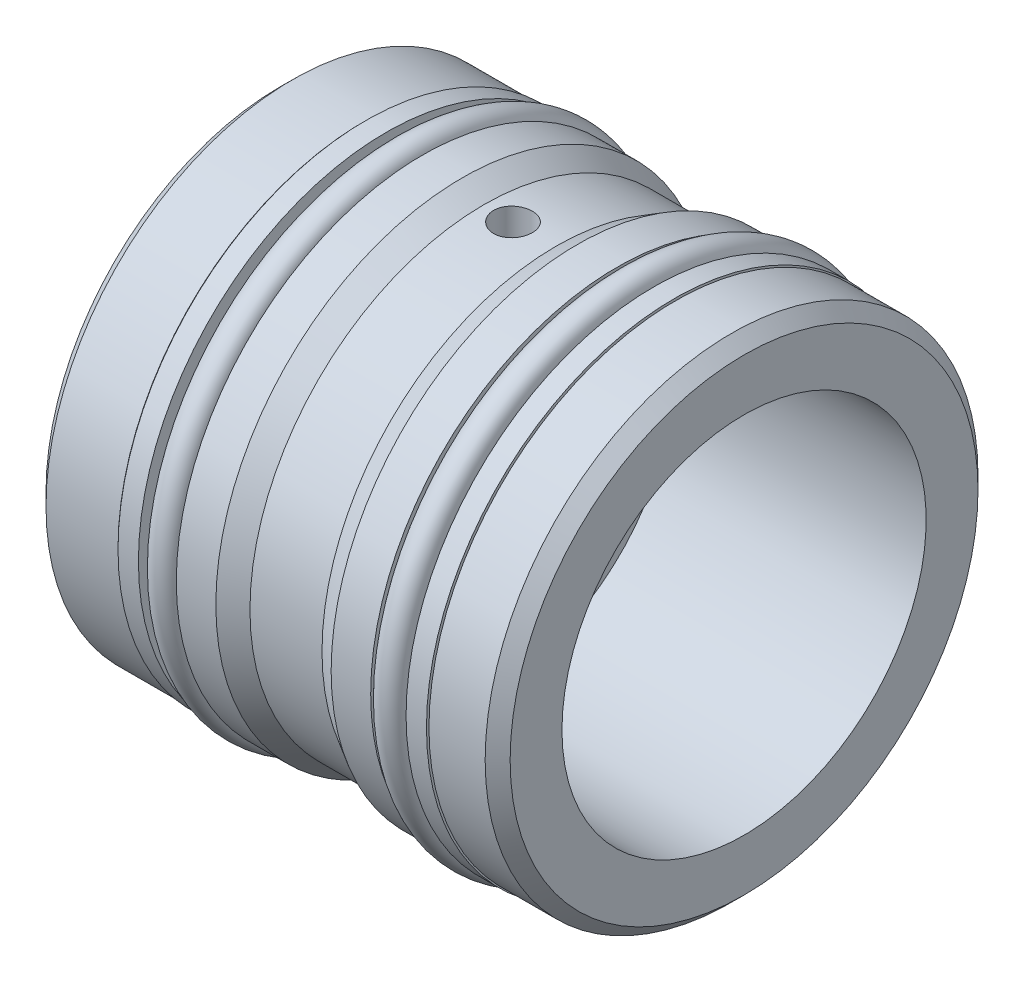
ISO-10303-21;
HEADER;
FILE_DESCRIPTION(('STEP AP214'),'2;1');
FILE_NAME('part.step','',(''),(''),'','','');
FILE_SCHEMA(('AUTOMOTIVE_DESIGN { 1 0 10303 214 1 1 1 1 }'));
ENDSEC;
DATA;
#1=APPLICATION_CONTEXT('core data for automotive mechanical design processes');
#2=APPLICATION_PROTOCOL_DEFINITION('international standard','automotive_design',2000,#1);
#3=PRODUCT_CONTEXT('',#1,'mechanical');
#4=PRODUCT('Part','Part','',(#3));
#5=PRODUCT_RELATED_PRODUCT_CATEGORY('part','',(#4));
#6=PRODUCT_DEFINITION_FORMATION('','',#4);
#7=PRODUCT_DEFINITION_CONTEXT('part definition',#1,'design');
#8=PRODUCT_DEFINITION('design','',#6,#7);
#9=PRODUCT_DEFINITION_SHAPE('','',#8);
#10=(LENGTH_UNIT() NAMED_UNIT(*) SI_UNIT(.MILLI.,.METRE.));
#11=(NAMED_UNIT(*) PLANE_ANGLE_UNIT() SI_UNIT($,.RADIAN.));
#12=(NAMED_UNIT(*) SI_UNIT($,.STERADIAN.) SOLID_ANGLE_UNIT());
#13=UNCERTAINTY_MEASURE_WITH_UNIT(LENGTH_MEASURE(1.E-05),#10,'distance_accuracy_value','');
#14=(GEOMETRIC_REPRESENTATION_CONTEXT(3) GLOBAL_UNCERTAINTY_ASSIGNED_CONTEXT((#13)) GLOBAL_UNIT_ASSIGNED_CONTEXT((#10,
#11,#12)) REPRESENTATION_CONTEXT('',''));
#15=CARTESIAN_POINT('',(0.,0.,0.));
#16=DIRECTION('',(0.,0.,1.));
#17=DIRECTION('',(1.,0.,0.));
#18=AXIS2_PLACEMENT_3D('',#15,#16,#17);
#19=CARTESIAN_POINT('',(0.,0.,0.));
#20=DIRECTION('',(-1.,0.,0.));
#21=DIRECTION('',(0.,0.,1.));
#22=AXIS2_PLACEMENT_3D('',#19,#20,#21);
#23=CYLINDRICAL_SURFACE('',#22,14.2748);
#24=CARTESIAN_POINT('',(2.6806772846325,0.,0.));
#25=DIRECTION('',(1.,0.,0.));
#26=DIRECTION('',(0.,0.,-1.));
#27=AXIS2_PLACEMENT_3D('',#24,#25,#26);
#28=CIRCLE('',#27,14.2748);
#29=CARTESIAN_POINT('',(2.6806772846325,0.,-14.2748));
#30=VERTEX_POINT('',#29);
#31=EDGE_CURVE('E39',#30,#30,#28,.T.);
#32=ORIENTED_EDGE('',*,*,#31,.F.);
#33=EDGE_LOOP('',(#32));
#34=FACE_BOUND('',#33,.T.);
#35=CARTESIAN_POINT('',(0.0634999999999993,-14.2258538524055,1.1811));
#36=CARTESIAN_POINT('',(0.129720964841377,-14.2258545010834,1.18109710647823));
#37=CARTESIAN_POINT('',(0.195987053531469,-14.2263212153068,1.17551202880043));
#38=CARTESIAN_POINT('',(0.32668585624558,-14.2281376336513,1.1533142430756));
#39=CARTESIAN_POINT('',(0.391116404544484,-14.2294883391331,1.13668902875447));
#40=CARTESIAN_POINT('',(0.516232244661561,-14.2329187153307,1.09289497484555));
#41=CARTESIAN_POINT('',(0.576919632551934,-14.2349979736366,1.06573209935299));
#42=CARTESIAN_POINT('',(0.692859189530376,-14.2396506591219,1.00164435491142));
#43=CARTESIAN_POINT('',(0.748112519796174,-14.2422239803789,0.964721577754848));
#44=CARTESIAN_POINT('',(0.851769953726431,-14.2475821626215,0.882061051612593));
#45=CARTESIAN_POINT('',(0.900158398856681,-14.2503674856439,0.836303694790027));
#46=CARTESIAN_POINT('',(0.988577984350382,-14.2558316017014,0.737314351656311));
#47=CARTESIAN_POINT('',(1.02860876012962,-14.2585103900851,0.684082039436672));
#48=CARTESIAN_POINT('',(1.09922867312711,-14.2634639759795,0.571560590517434));
#49=CARTESIAN_POINT('',(1.12980427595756,-14.2657381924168,0.512262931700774));
#50=CARTESIAN_POINT('',(1.18055933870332,-14.2696214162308,0.389353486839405));
#51=CARTESIAN_POINT('',(1.20073897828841,-14.2712304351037,0.32574177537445));
#52=CARTESIAN_POINT('',(1.23008425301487,-14.2735987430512,0.196165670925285));
#53=CARTESIAN_POINT('',(1.2392752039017,-14.2743599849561,0.130207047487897));
#54=CARTESIAN_POINT('',(1.24646046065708,-14.2749535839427,-0.00232075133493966));
#55=CARTESIAN_POINT('',(1.24445497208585,-14.2747859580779,-0.0688899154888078));
#56=CARTESIAN_POINT('',(1.22932498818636,-14.2735423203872,-0.200577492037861));
#57=CARTESIAN_POINT('',(1.21622771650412,-14.2724685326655,-0.265699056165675));
#58=CARTESIAN_POINT('',(1.17932827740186,-14.2695359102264,-0.392816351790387));
#59=CARTESIAN_POINT('',(1.15552600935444,-14.2676770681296,-0.454812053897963));
#60=CARTESIAN_POINT('',(1.09786187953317,-14.2633796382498,-0.574004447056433));
#61=CARTESIAN_POINT('',(1.0639878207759,-14.2609403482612,-0.631195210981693));
#62=CARTESIAN_POINT('',(0.987150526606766,-14.2557561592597,-0.739089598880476));
#63=CARTESIAN_POINT('',(0.944187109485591,-14.2530112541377,-0.789793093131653));
#64=CARTESIAN_POINT('',(0.850237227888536,-14.2475146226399,-0.883432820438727));
#65=CARTESIAN_POINT('',(0.79922710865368,-14.2447629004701,-0.926345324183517));
#66=CARTESIAN_POINT('',(0.690714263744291,-14.2395710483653,-1.0030016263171));
#67=CARTESIAN_POINT('',(0.633211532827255,-14.237130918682,-1.03674541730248));
#68=CARTESIAN_POINT('',(0.513329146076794,-14.2328380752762,-1.09410550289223));
#69=CARTESIAN_POINT('',(0.450948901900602,-14.2309854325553,-1.11772057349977));
#70=CARTESIAN_POINT('',(0.323090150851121,-14.2280786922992,-1.15413534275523));
#71=CARTESIAN_POINT('',(0.257611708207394,-14.2270245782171,-1.16693526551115));
#72=CARTESIAN_POINT('',(0.125622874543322,-14.2258369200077,-1.18132637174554));
#73=CARTESIAN_POINT('',(0.0591161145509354,-14.2257006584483,-1.18295064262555));
#74=CARTESIAN_POINT('',(-0.073223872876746,-14.2263569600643,-1.17503100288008));
#75=CARTESIAN_POINT('',(-0.13905710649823,-14.227149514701,-1.16548719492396));
#76=CARTESIAN_POINT('',(-0.268086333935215,-14.2295716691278,-1.13552989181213));
#77=CARTESIAN_POINT('',(-0.331285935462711,-14.2312000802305,-1.1151318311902));
#78=CARTESIAN_POINT('',(-0.453365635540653,-14.2351094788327,-1.06406073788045));
#79=CARTESIAN_POINT('',(-0.512245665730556,-14.2373904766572,-1.03338754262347));
#80=CARTESIAN_POINT('',(-0.624166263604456,-14.2423546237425,-0.962553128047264));
#81=CARTESIAN_POINT('',(-0.677192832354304,-14.245038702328,-0.922369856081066));
#82=CARTESIAN_POINT('',(-0.775759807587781,-14.2505034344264,-0.833687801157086));
#83=CARTESIAN_POINT('',(-0.821300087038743,-14.253284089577,-0.785188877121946));
#84=CARTESIAN_POINT('',(-0.90371466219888,-14.2586367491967,-0.681109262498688));
#85=CARTESIAN_POINT('',(-0.940567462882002,-14.2612082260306,-0.625511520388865));
#86=CARTESIAN_POINT('',(-1.00441349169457,-14.2658451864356,-0.50889747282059));
#87=CARTESIAN_POINT('',(-1.03140681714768,-14.2679106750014,-0.447881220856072));
#88=CARTESIAN_POINT('',(-1.07473072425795,-14.2713005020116,-0.322239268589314));
#89=CARTESIAN_POINT('',(-1.09107460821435,-14.272625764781,-0.257618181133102));
#90=CARTESIAN_POINT('',(-1.11267916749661,-14.2743895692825,-0.126537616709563));
#91=CARTESIAN_POINT('',(-1.11794004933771,-14.2748281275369,-0.0600781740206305));
#92=CARTESIAN_POINT('',(-1.1172268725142,-14.2747691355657,0.072580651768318));
#93=CARTESIAN_POINT('',(-1.1112863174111,-14.2742743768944,0.138780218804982));
#94=CARTESIAN_POINT('',(-1.08840875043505,-14.2724098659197,0.269238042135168));
#95=CARTESIAN_POINT('',(-1.07147172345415,-14.2710401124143,0.33349629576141));
#96=CARTESIAN_POINT('',(-1.02709048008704,-14.2675793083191,0.458249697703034));
#97=CARTESIAN_POINT('',(-0.999646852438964,-14.2654882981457,0.518745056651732));
#98=CARTESIAN_POINT('',(-0.93503529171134,-14.2608189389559,0.634275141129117));
#99=CARTESIAN_POINT('',(-0.897867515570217,-14.2582405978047,0.689309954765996));
#100=CARTESIAN_POINT('',(-0.814736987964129,-14.25287681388,0.79252814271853));
#101=CARTESIAN_POINT('',(-0.768749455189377,-14.2500908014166,0.840691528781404));
#102=CARTESIAN_POINT('',(-0.669329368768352,-14.2446305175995,0.928635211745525));
#103=CARTESIAN_POINT('',(-0.615895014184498,-14.2419562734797,0.968413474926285));
#104=CARTESIAN_POINT('',(-0.502995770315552,-14.237016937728,1.03851079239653));
#105=CARTESIAN_POINT('',(-0.443519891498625,-14.2347526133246,1.0688121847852));
#106=CARTESIAN_POINT('',(-0.320346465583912,-14.2308988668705,1.11895973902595));
#107=CARTESIAN_POINT('',(-0.256653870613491,-14.2293086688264,1.13881792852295));
#108=CARTESIAN_POINT('',(-0.149904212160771,-14.2273924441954,1.16245437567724));
#109=CARTESIAN_POINT('',(-0.107533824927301,-14.2268181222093,1.16943719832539));
#110=CARTESIAN_POINT('',(-0.0222819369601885,-14.2260486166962,1.17876094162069));
#111=CARTESIAN_POINT('',(0.0205995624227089,-14.2258534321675,1.18110187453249));
#112=CARTESIAN_POINT('',(0.0634999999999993,-14.2258538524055,1.1811));
#113=B_SPLINE_CURVE_WITH_KNOTS('',3,(#35,#36,#37,#38,#39,#40,#41,#42,#43,#44,#45,#46,#47,#48,
#49,#50,#51,#52,#53,#54,#55,#56,#57,#58,#59,#60,#61,#62,#63,#64,#65,#66,#67,#68,#69,#70,#71,#72,
#73,#74,#75,#76,#77,#78,#79,#80,#81,#82,#83,#84,#85,#86,#87,#88,#89,#90,#91,#92,#93,#94,#95,#96,
#97,#98,#99,#100,#101,#102,#103,#104,#105,#106,#107,#108,#109,#110,#111,#112),.UNSPECIFIED.,.T.,
.F.,(4,2,2,2,2,2,2,2,2,2,2,2,2,2,2,2,2,2,2,2,2,2,2,2,2,2,2,2,2,2,2,2,2,2,2,2,2,2,4),(0.,
0.198506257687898,0.397237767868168,0.595856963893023,0.794433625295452,0.993456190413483,
1.1924874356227,1.39180227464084,1.59111366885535,1.78996499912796,1.98881267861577,
2.18717371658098,2.38553661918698,2.58414072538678,2.78274880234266,2.98195199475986,
3.18115534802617,3.38038276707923,3.57960605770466,3.77823925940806,3.97687063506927,
4.17522031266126,4.3735731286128,4.57239048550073,4.77121121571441,4.97051883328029,
5.16982448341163,5.3688806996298,5.5679332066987,5.76639129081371,5.96484964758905,
6.16329688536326,6.36174092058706,6.5607509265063,6.75980914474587,6.95923616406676,
7.15843299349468,7.28703317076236,7.41563300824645),.UNSPECIFIED.);
#114=CARTESIAN_POINT('',(0.0634999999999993,-14.2258538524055,1.1811));
#115=VERTEX_POINT('',#114);
#116=EDGE_CURVE('E50',#115,#115,#113,.T.);
#117=ORIENTED_EDGE('',*,*,#116,.T.);
#118=EDGE_LOOP('',(#117));
#119=FACE_BOUND('',#118,.T.);
#120=CARTESIAN_POINT('',(0.0634999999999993,14.2258538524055,1.1811));
#121=CARTESIAN_POINT('',(-0.002720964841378,14.2258545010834,1.18109710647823));
#122=CARTESIAN_POINT('',(-0.0689870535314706,14.2263212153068,1.17551202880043));
#123=CARTESIAN_POINT('',(-0.199685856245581,14.2281376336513,1.1533142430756));
#124=CARTESIAN_POINT('',(-0.264116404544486,14.2294883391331,1.13668902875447));
#125=CARTESIAN_POINT('',(-0.389232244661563,14.2329187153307,1.09289497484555));
#126=CARTESIAN_POINT('',(-0.449919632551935,14.2349979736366,1.06573209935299));
#127=CARTESIAN_POINT('',(-0.565859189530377,14.2396506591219,1.00164435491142));
#128=CARTESIAN_POINT('',(-0.621112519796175,14.2422239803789,0.964721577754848));
#129=CARTESIAN_POINT('',(-0.724769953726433,14.2475821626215,0.882061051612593));
#130=CARTESIAN_POINT('',(-0.773158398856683,14.2503674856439,0.836303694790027));
#131=CARTESIAN_POINT('',(-0.861577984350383,14.2558316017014,0.737314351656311));
#132=CARTESIAN_POINT('',(-0.901608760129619,14.2585103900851,0.684082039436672));
#133=CARTESIAN_POINT('',(-0.972228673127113,14.2634639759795,0.571560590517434));
#134=CARTESIAN_POINT('',(-1.00280427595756,14.2657381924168,0.512262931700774));
#135=CARTESIAN_POINT('',(-1.05355933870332,14.2696214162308,0.389353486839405));
#136=CARTESIAN_POINT('',(-1.07373897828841,14.2712304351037,0.32574177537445));
#137=CARTESIAN_POINT('',(-1.10308425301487,14.2735987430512,0.196165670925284));
#138=CARTESIAN_POINT('',(-1.11227520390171,14.2743599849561,0.130207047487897));
#139=CARTESIAN_POINT('',(-1.11946046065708,14.2749535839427,-0.00232075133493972));
#140=CARTESIAN_POINT('',(-1.11745497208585,14.2747859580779,-0.0688899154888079));
#141=CARTESIAN_POINT('',(-1.10232498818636,14.2735423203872,-0.200577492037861));
#142=CARTESIAN_POINT('',(-1.08922771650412,14.2724685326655,-0.265699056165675));
#143=CARTESIAN_POINT('',(-1.05232827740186,14.2695359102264,-0.392816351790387));
#144=CARTESIAN_POINT('',(-1.02852600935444,14.2676770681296,-0.454812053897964));
#145=CARTESIAN_POINT('',(-0.970861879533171,14.2633796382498,-0.574004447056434));
#146=CARTESIAN_POINT('',(-0.936987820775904,14.2609403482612,-0.631195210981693));
#147=CARTESIAN_POINT('',(-0.860150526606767,14.2557561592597,-0.739089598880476));
#148=CARTESIAN_POINT('',(-0.817187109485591,14.2530112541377,-0.789793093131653));
#149=CARTESIAN_POINT('',(-0.723237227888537,14.2475146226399,-0.883432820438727));
#150=CARTESIAN_POINT('',(-0.672227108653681,14.2447629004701,-0.926345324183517));
#151=CARTESIAN_POINT('',(-0.563714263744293,14.2395710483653,-1.0030016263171));
#152=CARTESIAN_POINT('',(-0.506211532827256,14.237130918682,-1.03674541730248));
#153=CARTESIAN_POINT('',(-0.386329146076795,14.2328380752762,-1.09410550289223));
#154=CARTESIAN_POINT('',(-0.323948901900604,14.2309854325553,-1.11772057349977));
#155=CARTESIAN_POINT('',(-0.196090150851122,14.2280786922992,-1.15413534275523));
#156=CARTESIAN_POINT('',(-0.130611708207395,14.2270245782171,-1.16693526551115));
#157=CARTESIAN_POINT('',(0.00137712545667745,14.2258369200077,-1.18132637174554));
#158=CARTESIAN_POINT('',(0.0678838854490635,14.2257006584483,-1.18295064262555));
#159=CARTESIAN_POINT('',(0.200223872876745,14.2263569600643,-1.17503100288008));
#160=CARTESIAN_POINT('',(0.266057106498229,14.227149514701,-1.16548719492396));
#161=CARTESIAN_POINT('',(0.395086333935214,14.2295716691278,-1.13552989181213));
#162=CARTESIAN_POINT('',(0.45828593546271,14.2312000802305,-1.1151318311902));
#163=CARTESIAN_POINT('',(0.580365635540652,14.2351094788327,-1.06406073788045));
#164=CARTESIAN_POINT('',(0.639245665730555,14.2373904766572,-1.03338754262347));
#165=CARTESIAN_POINT('',(0.751166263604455,14.2423546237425,-0.962553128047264));
#166=CARTESIAN_POINT('',(0.804192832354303,14.245038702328,-0.922369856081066));
#167=CARTESIAN_POINT('',(0.90275980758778,14.2505034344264,-0.833687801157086));
#168=CARTESIAN_POINT('',(0.948300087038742,14.253284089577,-0.785188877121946));
#169=CARTESIAN_POINT('',(1.03071466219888,14.2586367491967,-0.681109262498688));
#170=CARTESIAN_POINT('',(1.067567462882,14.2612082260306,-0.625511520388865));
#171=CARTESIAN_POINT('',(1.13141349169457,14.2658451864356,-0.50889747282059));
#172=CARTESIAN_POINT('',(1.15840681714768,14.2679106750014,-0.447881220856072));
#173=CARTESIAN_POINT('',(1.20173072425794,14.2713005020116,-0.322239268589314));
#174=CARTESIAN_POINT('',(1.21807460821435,14.272625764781,-0.257618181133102));
#175=CARTESIAN_POINT('',(1.2396791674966,14.2743895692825,-0.126537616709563));
#176=CARTESIAN_POINT('',(1.24494004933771,14.2748281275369,-0.0600781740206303));
#177=CARTESIAN_POINT('',(1.2442268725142,14.2747691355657,0.0725806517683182));
#178=CARTESIAN_POINT('',(1.2382863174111,14.2742743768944,0.138780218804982));
#179=CARTESIAN_POINT('',(1.21540875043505,14.2724098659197,0.269238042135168));
#180=CARTESIAN_POINT('',(1.19847172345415,14.2710401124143,0.33349629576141));
#181=CARTESIAN_POINT('',(1.15409048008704,14.2675793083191,0.458249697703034));
#182=CARTESIAN_POINT('',(1.12664685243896,14.2654882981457,0.518745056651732));
#183=CARTESIAN_POINT('',(1.06203529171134,14.2608189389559,0.634275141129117));
#184=CARTESIAN_POINT('',(1.02486751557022,14.2582405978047,0.689309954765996));
#185=CARTESIAN_POINT('',(0.941736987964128,14.25287681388,0.79252814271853));
#186=CARTESIAN_POINT('',(0.895749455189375,14.2500908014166,0.840691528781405));
#187=CARTESIAN_POINT('',(0.79632936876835,14.2446305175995,0.928635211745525));
#188=CARTESIAN_POINT('',(0.742895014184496,14.2419562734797,0.968413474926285));
#189=CARTESIAN_POINT('',(0.62999577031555,14.237016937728,1.03851079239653));
#190=CARTESIAN_POINT('',(0.570519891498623,14.2347526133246,1.0688121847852));
#191=CARTESIAN_POINT('',(0.44734646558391,14.2308988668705,1.11895973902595));
#192=CARTESIAN_POINT('',(0.383653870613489,14.2293086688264,1.13881792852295));
#193=CARTESIAN_POINT('',(0.276904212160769,14.2273924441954,1.16245437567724));
#194=CARTESIAN_POINT('',(0.234533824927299,14.2268181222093,1.16943719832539));
#195=CARTESIAN_POINT('',(0.149281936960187,14.2260486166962,1.17876094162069));
#196=CARTESIAN_POINT('',(0.106400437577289,14.2258534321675,1.18110187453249));
#197=CARTESIAN_POINT('',(0.0634999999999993,14.2258538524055,1.1811));
#198=B_SPLINE_CURVE_WITH_KNOTS('',3,(#120,#121,#122,#123,#124,#125,#126,#127,#128,#129,#130,
#131,#132,#133,#134,#135,#136,#137,#138,#139,#140,#141,#142,#143,#144,#145,#146,#147,#148,#149,
#150,#151,#152,#153,#154,#155,#156,#157,#158,#159,#160,#161,#162,#163,#164,#165,#166,#167,#168,
#169,#170,#171,#172,#173,#174,#175,#176,#177,#178,#179,#180,#181,#182,#183,#184,#185,#186,#187,
#188,#189,#190,#191,#192,#193,#194,#195,#196,#197),.UNSPECIFIED.,.T.,.F.,(4,2,2,2,2,2,2,2,2,2,2,
2,2,2,2,2,2,2,2,2,2,2,2,2,2,2,2,2,2,2,2,2,2,2,2,2,2,2,4),(0.,0.198506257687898,
0.397237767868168,0.595856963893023,0.794433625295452,0.993456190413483,1.1924874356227,
1.39180227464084,1.59111366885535,1.78996499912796,1.98881267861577,2.18717371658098,
2.38553661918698,2.58414072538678,2.78274880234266,2.98195199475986,3.18115534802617,
3.38038276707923,3.57960605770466,3.77823925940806,3.97687063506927,4.17522031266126,
4.3735731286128,4.57239048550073,4.77121121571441,4.97051883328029,5.16982448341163,
5.3688806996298,5.5679332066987,5.76639129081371,5.96484964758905,6.16329688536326,
6.36174092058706,6.5607509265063,6.75980914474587,6.95923616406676,7.15843299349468,
7.28703317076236,7.41563300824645),.UNSPECIFIED.);
#199=CARTESIAN_POINT('',(0.0634999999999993,14.2258538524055,1.1811));
#200=VERTEX_POINT('',#199);
#201=EDGE_CURVE('E58',#200,#200,#198,.T.);
#202=ORIENTED_EDGE('',*,*,#201,.T.);
#203=EDGE_LOOP('',(#202));
#204=FACE_BOUND('',#203,.T.);
#205=CARTESIAN_POINT('',(-1.7154772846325,0.,0.));
#206=DIRECTION('',(-1.,0.,0.));
#207=DIRECTION('',(0.,0.,1.));
#208=AXIS2_PLACEMENT_3D('',#205,#206,#207);
#209=CIRCLE('',#208,14.2748);
#210=CARTESIAN_POINT('',(-1.7154772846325,0.,14.2748));
#211=VERTEX_POINT('',#210);
#212=EDGE_CURVE('E10',#211,#211,#209,.T.);
#213=ORIENTED_EDGE('',*,*,#212,.F.);
#214=EDGE_LOOP('',(#213));
#215=FACE_BOUND('',#214,.T.);
#216=ADVANCED_FACE('F32',(#34,#119,#204,#215),#23,.T.);
#217=CARTESIAN_POINT('',(0.,0.,0.));
#218=DIRECTION('',(-1.,0.,0.));
#219=DIRECTION('',(0.,0.,1.));
#220=AXIS2_PLACEMENT_3D('',#217,#218,#219);
#221=CYLINDRICAL_SURFACE('',#220,13.7668);
#222=CARTESIAN_POINT('',(7.73880715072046,0.,0.));
#223=DIRECTION('',(-1.,0.,0.));
#224=DIRECTION('',(0.,0.,1.));
#225=AXIS2_PLACEMENT_3D('',#222,#223,#224);
#226=CIRCLE('',#225,13.7668);
#227=CARTESIAN_POINT('',(7.73880715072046,0.,13.7668));
#228=VERTEX_POINT('',#227);
#229=EDGE_CURVE('E208',#228,#228,#226,.T.);
#230=ORIENTED_EDGE('',*,*,#229,.F.);
#231=EDGE_LOOP('',(#230));
#232=FACE_BOUND('',#231,.T.);
#233=CARTESIAN_POINT('',(8.6487,0.,0.));
#234=DIRECTION('',(1.,0.,0.));
#235=DIRECTION('',(0.,0.,-1.));
#236=AXIS2_PLACEMENT_3D('',#233,#234,#235);
#237=CIRCLE('',#236,13.7668);
#238=CARTESIAN_POINT('',(8.6487,0.,-13.7668));
#239=VERTEX_POINT('',#238);
#240=EDGE_CURVE('E43',#239,#239,#237,.T.);
#241=ORIENTED_EDGE('',*,*,#240,.F.);
#242=EDGE_LOOP('',(#241));
#243=FACE_BOUND('',#242,.T.);
#244=ADVANCED_FACE('F123',(#232,#243),#221,.T.);
#245=CARTESIAN_POINT('',(9.9695,0.,0.));
#246=DIRECTION('',(-1.,0.,0.));
#247=DIRECTION('',(0.,0.,1.));
#248=AXIS2_PLACEMENT_3D('',#245,#246,#247);
#249=CIRCLE('',#248,13.7668);
#250=CARTESIAN_POINT('',(9.9695,0.,13.7668));
#251=VERTEX_POINT('',#250);
#252=EDGE_CURVE('E169',#251,#251,#249,.T.);
#253=ORIENTED_EDGE('',*,*,#252,.T.);
#254=EDGE_LOOP('',(#253));
#255=FACE_BOUND('',#254,.T.);
#256=CARTESIAN_POINT('',(9.89329999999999,0.,0.));
#257=DIRECTION('',(-1.,0.,0.));
#258=DIRECTION('',(0.,0.,1.));
#259=AXIS2_PLACEMENT_3D('',#256,#257,#258);
#260=CIRCLE('',#259,13.7668);
#261=CARTESIAN_POINT('',(9.89329999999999,0.,13.7668));
#262=VERTEX_POINT('',#261);
#263=EDGE_CURVE('E47',#262,#262,#260,.T.);
#264=ORIENTED_EDGE('',*,*,#263,.F.);
#265=EDGE_LOOP('',(#264));
#266=FACE_BOUND('',#265,.T.);
#267=ADVANCED_FACE('F128',(#255,#266),#221,.T.);
#268=CARTESIAN_POINT('',(6.4135,0.,0.));
#269=DIRECTION('',(-1.,0.,0.));
#270=DIRECTION('',(0.,0.,1.));
#271=AXIS2_PLACEMENT_3D('',#268,#269,#270);
#272=CIRCLE('',#271,13.7668);
#273=CARTESIAN_POINT('',(6.4135,0.,13.7668));
#274=VERTEX_POINT('',#273);
#275=EDGE_CURVE('E160',#274,#274,#272,.T.);
#276=ORIENTED_EDGE('',*,*,#275,.F.);
#277=EDGE_LOOP('',(#276));
#278=FACE_BOUND('',#277,.T.);
#279=CARTESIAN_POINT('',(7.01859284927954,0.,0.));
#280=DIRECTION('',(1.,0.,0.));
#281=DIRECTION('',(0.,0.,-1.));
#282=AXIS2_PLACEMENT_3D('',#279,#280,#281);
#283=CIRCLE('',#282,13.7668);
#284=CARTESIAN_POINT('',(7.01859284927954,0.,-13.7668));
#285=VERTEX_POINT('',#284);
#286=EDGE_CURVE('E211',#285,#285,#283,.T.);
#287=ORIENTED_EDGE('',*,*,#286,.F.);
#288=EDGE_LOOP('',(#287));
#289=FACE_BOUND('',#288,.T.);
#290=ADVANCED_FACE('F131',(#278,#289),#221,.T.);
#291=CARTESIAN_POINT('',(0.,0.,0.));
#292=DIRECTION('',(-1.,0.,0.));
#293=DIRECTION('',(0.,0.,1.));
#294=AXIS2_PLACEMENT_3D('',#291,#292,#293);
#295=CYLINDRICAL_SURFACE('',#294,13.7668);
#296=CARTESIAN_POINT('',(-7.6835,0.,0.));
#297=DIRECTION('',(-1.,0.,0.));
#298=DIRECTION('',(0.,0.,1.));
#299=AXIS2_PLACEMENT_3D('',#296,#297,#298);
#300=CIRCLE('',#299,13.7668);
#301=CARTESIAN_POINT('',(-7.6835,0.,13.7668));
#302=VERTEX_POINT('',#301);
#303=EDGE_CURVE('E196',#302,#302,#300,.T.);
#304=ORIENTED_EDGE('',*,*,#303,.F.);
#305=EDGE_LOOP('',(#304));
#306=FACE_BOUND('',#305,.T.);
#307=CARTESIAN_POINT('',(-6.77360715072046,0.,0.));
#308=DIRECTION('',(1.,0.,0.));
#309=DIRECTION('',(0.,0.,-1.));
#310=AXIS2_PLACEMENT_3D('',#307,#308,#309);
#311=CIRCLE('',#310,13.7668);
#312=CARTESIAN_POINT('',(-6.77360715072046,0.,-13.7668));
#313=VERTEX_POINT('',#312);
#314=EDGE_CURVE('E205',#313,#313,#311,.T.);
#315=ORIENTED_EDGE('',*,*,#314,.F.);
#316=EDGE_LOOP('',(#315));
#317=FACE_BOUND('',#316,.T.);
#318=ADVANCED_FACE('F223',(#306,#317),#295,.T.);
#319=CARTESIAN_POINT('',(-5.4483,0.,0.));
#320=DIRECTION('',(-1.,0.,0.));
#321=DIRECTION('',(0.,0.,1.));
#322=AXIS2_PLACEMENT_3D('',#319,#320,#321);
#323=CIRCLE('',#322,13.7668);
#324=CARTESIAN_POINT('',(-5.4483,0.,13.7668));
#325=VERTEX_POINT('',#324);
#326=EDGE_CURVE('E163',#325,#325,#323,.T.);
#327=ORIENTED_EDGE('',*,*,#326,.T.);
#328=EDGE_LOOP('',(#327));
#329=FACE_BOUND('',#328,.T.);
#330=CARTESIAN_POINT('',(-6.05339284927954,0.,0.));
#331=DIRECTION('',(-1.,0.,0.));
#332=DIRECTION('',(0.,0.,1.));
#333=AXIS2_PLACEMENT_3D('',#330,#331,#332);
#334=CIRCLE('',#333,13.7668);
#335=CARTESIAN_POINT('',(-6.05339284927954,0.,13.7668));
#336=VERTEX_POINT('',#335);
#337=EDGE_CURVE('E202',#336,#336,#334,.T.);
#338=ORIENTED_EDGE('',*,*,#337,.F.);
#339=EDGE_LOOP('',(#338));
#340=FACE_BOUND('',#339,.T.);
#341=ADVANCED_FACE('F271',(#329,#340),#295,.T.);
#342=CARTESIAN_POINT('',(-9.0043,0.,0.));
#343=DIRECTION('',(-1.,0.,0.));
#344=DIRECTION('',(0.,0.,1.));
#345=AXIS2_PLACEMENT_3D('',#342,#343,#344);
#346=CIRCLE('',#345,13.7668);
#347=CARTESIAN_POINT('',(-9.0043,0.,13.7668));
#348=VERTEX_POINT('',#347);
#349=EDGE_CURVE('E260',#348,#348,#346,.T.);
#350=ORIENTED_EDGE('',*,*,#349,.F.);
#351=EDGE_LOOP('',(#350));
#352=FACE_BOUND('',#351,.T.);
#353=CARTESIAN_POINT('',(-8.9281,0.,0.));
#354=DIRECTION('',(1.,0.,0.));
#355=DIRECTION('',(0.,0.,-1.));
#356=AXIS2_PLACEMENT_3D('',#353,#354,#355);
#357=CIRCLE('',#356,13.7668);
#358=CARTESIAN_POINT('',(-8.9281,0.,-13.7668));
#359=VERTEX_POINT('',#358);
#360=EDGE_CURVE('E199',#359,#359,#357,.T.);
#361=ORIENTED_EDGE('',*,*,#360,.F.);
#362=EDGE_LOOP('',(#361));
#363=FACE_BOUND('',#362,.T.);
#364=ADVANCED_FACE('F105',(#352,#363),#295,.T.);
#365=CARTESIAN_POINT('',(0.,0.,0.));
#366=DIRECTION('',(-1.,0.,0.));
#367=DIRECTION('',(0.,0.,1.));
#368=AXIS2_PLACEMENT_3D('',#365,#366,#367);
#369=CYLINDRICAL_SURFACE('',#368,6.35);
#370=CARTESIAN_POINT('',(-1.2319,0.,0.));
#371=DIRECTION('',(-1.,0.,0.));
#372=DIRECTION('',(0.,0.,1.));
#373=AXIS2_PLACEMENT_3D('',#370,#371,#372);
#374=CIRCLE('',#373,6.35);
#375=CARTESIAN_POINT('',(-1.2319,0.,6.35));
#376=VERTEX_POINT('',#375);
#377=EDGE_CURVE('E181',#376,#376,#374,.T.);
#378=ORIENTED_EDGE('',*,*,#377,.F.);
#379=EDGE_LOOP('',(#378));
#380=FACE_BOUND('',#379,.T.);
#381=CARTESIAN_POINT('',(-14.1605,0.,0.));
#382=DIRECTION('',(-1.,0.,0.));
#383=DIRECTION('',(0.,0.,1.));
#384=AXIS2_PLACEMENT_3D('',#381,#382,#383);
#385=CIRCLE('',#384,6.35);
#386=CARTESIAN_POINT('',(-14.1605,0.,6.35));
#387=VERTEX_POINT('',#386);
#388=EDGE_CURVE('E254',#387,#387,#385,.T.);
#389=ORIENTED_EDGE('',*,*,#388,.T.);
#390=EDGE_LOOP('',(#389));
#391=FACE_BOUND('',#390,.T.);
#392=ADVANCED_FACE('F102',(#380,#391),#369,.F.);
#393=CARTESIAN_POINT('',(-1.2319,6.35,0.));
#394=DIRECTION('',(-1.,0.,0.));
#395=DIRECTION('',(0.,0.,1.));
#396=AXIS2_PLACEMENT_3D('',#393,#394,#395);
#397=PLANE('',#396);
#398=CARTESIAN_POINT('',(-1.2319,0.,0.));
#399=DIRECTION('',(-1.,0.,0.));
#400=DIRECTION('',(0.,0.,1.));
#401=AXIS2_PLACEMENT_3D('',#398,#399,#400);
#402=CIRCLE('',#401,11.1125);
#403=CARTESIAN_POINT('',(-1.2319,0.,11.1125));
#404=VERTEX_POINT('',#403);
#405=EDGE_CURVE('E178',#404,#404,#402,.T.);
#406=ORIENTED_EDGE('',*,*,#405,.F.);
#407=EDGE_LOOP('',(#406));
#408=FACE_BOUND('',#407,.T.);
#409=ORIENTED_EDGE('',*,*,#377,.T.);
#410=EDGE_LOOP('',(#409));
#411=FACE_BOUND('',#410,.T.);
#412=ADVANCED_FACE('F96',(#408,#411),#397,.F.);
#413=CARTESIAN_POINT('',(0.,0.,0.));
#414=DIRECTION('',(-1.,0.,0.));
#415=DIRECTION('',(0.,0.,1.));
#416=AXIS2_PLACEMENT_3D('',#413,#414,#415);
#417=CYLINDRICAL_SURFACE('',#416,11.1125);
#418=CARTESIAN_POINT('',(0.0634999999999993,-11.0495546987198,1.1811));
#419=CARTESIAN_POINT('',(-0.00264156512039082,-11.0495555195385,1.18109714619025));
#420=CARTESIAN_POINT('',(-0.0688263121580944,-11.0501549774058,1.17552539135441));
#421=CARTESIAN_POINT('',(-0.199359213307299,-11.0524875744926,1.15338363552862));
#422=CARTESIAN_POINT('',(-0.263705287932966,-11.054221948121,1.13680165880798));
#423=CARTESIAN_POINT('',(-0.388651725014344,-11.0586257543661,1.09312916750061));
#424=CARTESIAN_POINT('',(-0.449254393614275,-11.0612946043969,1.06604519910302));
#425=CARTESIAN_POINT('',(-0.565041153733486,-11.0672659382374,1.00215046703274));
#426=CARTESIAN_POINT('',(-0.620226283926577,-11.0705683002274,0.965341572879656));
#427=CARTESIAN_POINT('',(-0.723849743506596,-11.0774496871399,0.882880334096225));
#428=CARTESIAN_POINT('',(-0.772262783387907,-11.0810296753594,0.837196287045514));
#429=CARTESIAN_POINT('',(-0.860749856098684,-11.0880542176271,0.73834944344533));
#430=CARTESIAN_POINT('',(-0.900823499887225,-11.0914987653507,0.685186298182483));
#431=CARTESIAN_POINT('',(-0.971582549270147,-11.097873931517,0.57273433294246));
#432=CARTESIAN_POINT('',(-1.00224543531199,-11.1008033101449,0.5134312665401));
#433=CARTESIAN_POINT('',(-1.05316845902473,-11.105807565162,0.39048157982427));
#434=CARTESIAN_POINT('',(-1.07342888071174,-11.1078824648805,0.326835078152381));
#435=CARTESIAN_POINT('',(-1.10289730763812,-11.1109372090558,0.197261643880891));
#436=CARTESIAN_POINT('',(-1.11214699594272,-11.1119211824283,0.131344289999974));
#437=CARTESIAN_POINT('',(-1.1194604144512,-11.11269726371,-0.00111401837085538));
#438=CARTESIAN_POINT('',(-1.11752446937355,-11.1124894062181,-0.067654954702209));
#439=CARTESIAN_POINT('',(-1.10255531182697,-11.1109086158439,-0.199188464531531));
#440=CARTESIAN_POINT('',(-1.08956692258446,-11.1095403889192,-0.264186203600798));
#441=CARTESIAN_POINT('',(-1.05293145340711,-11.1057979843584,-0.391074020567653));
#442=CARTESIAN_POINT('',(-1.02928421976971,-11.1034237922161,-0.452964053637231));
#443=CARTESIAN_POINT('',(-0.971953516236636,-11.0979282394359,-0.572020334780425));
#444=CARTESIAN_POINT('',(-0.938250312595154,-11.0948054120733,-0.629177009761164));
#445=CARTESIAN_POINT('',(-0.861778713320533,-11.088162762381,-0.737039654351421));
#446=CARTESIAN_POINT('',(-0.819010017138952,-11.0846429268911,-0.787745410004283));
#447=CARTESIAN_POINT('',(-0.725369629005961,-11.0775804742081,-0.881529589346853));
#448=CARTESIAN_POINT('',(-0.674458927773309,-11.0740378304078,-0.924569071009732));
#449=CARTESIAN_POINT('',(-0.566114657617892,-11.0673463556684,-1.00149721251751));
#450=CARTESIAN_POINT('',(-0.508681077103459,-11.0641975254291,-1.0353858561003));
#451=CARTESIAN_POINT('',(-0.388890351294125,-11.0586500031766,-1.09305071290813));
#452=CARTESIAN_POINT('',(-0.326531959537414,-11.0562515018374,-1.11682435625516));
#453=CARTESIAN_POINT('',(-0.198677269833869,-11.0524801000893,-1.15355269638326));
#454=CARTESIAN_POINT('',(-0.133181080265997,-11.0511071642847,-1.16650776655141));
#455=CARTESIAN_POINT('',(-0.00125233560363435,-11.0495485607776,-1.1811807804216));
#456=CARTESIAN_POINT('',(0.0651740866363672,-11.049357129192,-1.1829532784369));
#457=CARTESIAN_POINT('',(0.197378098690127,-11.0501679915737,-1.17535425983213));
#458=CARTESIAN_POINT('',(0.263155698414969,-11.0511702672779,-1.16598291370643));
#459=CARTESIAN_POINT('',(0.392034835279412,-11.0542503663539,-1.13640793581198));
#460=CARTESIAN_POINT('',(0.455142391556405,-11.0563256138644,-1.11623024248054));
#461=CARTESIAN_POINT('',(0.577077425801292,-11.0613157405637,-1.0656418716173));
#462=CARTESIAN_POINT('',(0.635904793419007,-11.0642306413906,-1.03523093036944));
#463=CARTESIAN_POINT('',(0.74785779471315,-11.07058556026,-0.964903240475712));
#464=CARTESIAN_POINT('',(0.800960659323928,-11.0740275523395,-0.924950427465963));
#465=CARTESIAN_POINT('',(0.899726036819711,-11.0810424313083,-0.836724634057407));
#466=CARTESIAN_POINT('',(0.945388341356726,-11.0846153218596,-0.788451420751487));
#467=CARTESIAN_POINT('',(1.02816535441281,-11.091506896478,-0.684718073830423));
#468=CARTESIAN_POINT('',(1.06524441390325,-11.0948244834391,-0.629229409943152));
#469=CARTESIAN_POINT('',(1.12955677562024,-11.1008155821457,-0.512780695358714));
#470=CARTESIAN_POINT('',(1.15679022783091,-11.1034891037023,-0.451820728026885));
#471=CARTESIAN_POINT('',(1.20057826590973,-11.1078859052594,-0.326282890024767));
#472=CARTESIAN_POINT('',(1.21715416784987,-11.1096110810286,-0.261712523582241));
#473=CARTESIAN_POINT('',(1.2392260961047,-11.1119246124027,-0.130685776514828));
#474=CARTESIAN_POINT('',(1.2447224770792,-11.1125130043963,-0.064229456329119));
#475=CARTESIAN_POINT('',(1.24447398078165,-11.1124866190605,0.0683330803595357));
#476=CARTESIAN_POINT('',(1.23878435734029,-11.1118777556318,0.134439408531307));
#477=CARTESIAN_POINT('',(1.21644149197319,-11.1095369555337,0.264751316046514));
#478=CARTESIAN_POINT('',(1.19978824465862,-11.1078050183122,0.328956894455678));
#479=CARTESIAN_POINT('',(1.15600665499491,-11.1034120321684,0.453642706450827));
#480=CARTESIAN_POINT('',(1.1288801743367,-11.1007511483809,0.514123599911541));
#481=CARTESIAN_POINT('',(1.0649279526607,-11.0947964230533,0.629682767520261));
#482=CARTESIAN_POINT('',(1.02810222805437,-11.0915025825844,0.684761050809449));
#483=CARTESIAN_POINT('',(0.945590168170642,-11.0846311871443,0.788234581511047));
#484=CARTESIAN_POINT('',(0.899862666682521,-11.0810523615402,0.836596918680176));
#485=CARTESIAN_POINT('',(0.800927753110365,-11.0740249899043,0.92498548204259));
#486=CARTESIAN_POINT('',(0.747718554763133,-11.0705764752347,0.965009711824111));
#487=CARTESIAN_POINT('',(0.635163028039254,-11.0641897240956,1.03567775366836));
#488=CARTESIAN_POINT('',(0.575799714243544,-11.0612529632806,1.06629462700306));
#489=CARTESIAN_POINT('',(0.452780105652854,-11.0562397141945,1.11708410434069));
#490=CARTESIAN_POINT('',(0.389128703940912,-11.054162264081,1.13726839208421));
#491=CARTESIAN_POINT('',(0.281519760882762,-11.051622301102,1.16163240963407));
#492=CARTESIAN_POINT('',(0.238248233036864,-11.0508506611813,1.16892266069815));
#493=CARTESIAN_POINT('',(0.151157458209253,-11.0498165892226,1.17865738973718));
#494=CARTESIAN_POINT('',(0.107338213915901,-11.0495541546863,1.18110189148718));
#495=CARTESIAN_POINT('',(0.0634999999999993,-11.0495546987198,1.1811));
#496=B_SPLINE_CURVE_WITH_KNOTS('',3,(#418,#419,#420,#421,#422,#423,#424,#425,#426,#427,#428,
#429,#430,#431,#432,#433,#434,#435,#436,#437,#438,#439,#440,#441,#442,#443,#444,#445,#446,#447,
#448,#449,#450,#451,#452,#453,#454,#455,#456,#457,#458,#459,#460,#461,#462,#463,#464,#465,#466,
#467,#468,#469,#470,#471,#472,#473,#474,#475,#476,#477,#478,#479,#480,#481,#482,#483,#484,#485,
#486,#487,#488,#489,#490,#491,#492,#493,#494,#495),.UNSPECIFIED.,.T.,.F.,(4,2,2,2,2,2,2,2,2,2,2,
2,2,2,2,2,2,2,2,2,2,2,2,2,2,2,2,2,2,2,2,2,2,2,2,2,2,2,4),(0.,0.198264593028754,
0.396745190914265,0.595102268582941,0.793421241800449,0.99246209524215,1.19151223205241,
1.39103503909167,1.59055239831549,1.78931202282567,1.98806587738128,2.18601750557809,
2.38397198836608,2.58231751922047,2.78066962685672,2.98000221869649,3.17933516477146,
3.37871872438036,3.57809540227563,3.77649866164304,3.97489888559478,4.17282501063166,
4.37075623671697,4.5694477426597,4.76814481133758,4.96765289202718,5.16715793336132,
5.36626269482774,5.56536108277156,5.76347848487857,5.96159598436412,6.15967828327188,
6.35776024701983,6.55678098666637,6.75584932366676,6.95548250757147,7.15489162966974,
7.28630080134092,7.41770932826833),.UNSPECIFIED.);
#497=CARTESIAN_POINT('',(0.0634999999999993,-11.0495546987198,1.1811));
#498=VERTEX_POINT('',#497);
#499=EDGE_CURVE('E85',#498,#498,#496,.T.);
#500=ORIENTED_EDGE('',*,*,#499,.T.);
#501=EDGE_LOOP('',(#500));
#502=FACE_BOUND('',#501,.T.);
#503=CARTESIAN_POINT('',(0.0634999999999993,11.0495546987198,1.1811));
#504=CARTESIAN_POINT('',(0.129641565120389,11.0495555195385,1.18109714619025));
#505=CARTESIAN_POINT('',(0.195826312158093,11.0501549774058,1.17552539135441));
#506=CARTESIAN_POINT('',(0.326359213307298,11.0524875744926,1.15338363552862));
#507=CARTESIAN_POINT('',(0.390705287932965,11.054221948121,1.13680165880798));
#508=CARTESIAN_POINT('',(0.515651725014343,11.0586257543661,1.09312916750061));
#509=CARTESIAN_POINT('',(0.576254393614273,11.0612946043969,1.06604519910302));
#510=CARTESIAN_POINT('',(0.692041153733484,11.0672659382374,1.00215046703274));
#511=CARTESIAN_POINT('',(0.747226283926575,11.0705683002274,0.965341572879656));
#512=CARTESIAN_POINT('',(0.850849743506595,11.0774496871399,0.882880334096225));
#513=CARTESIAN_POINT('',(0.899262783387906,11.0810296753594,0.837196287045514));
#514=CARTESIAN_POINT('',(0.987749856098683,11.0880542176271,0.73834944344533));
#515=CARTESIAN_POINT('',(1.02782349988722,11.0914987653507,0.685186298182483));
#516=CARTESIAN_POINT('',(1.09858254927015,11.097873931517,0.57273433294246));
#517=CARTESIAN_POINT('',(1.12924543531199,11.1008033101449,0.5134312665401));
#518=CARTESIAN_POINT('',(1.18016845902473,11.105807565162,0.39048157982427));
#519=CARTESIAN_POINT('',(1.20042888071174,11.1078824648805,0.326835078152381));
#520=CARTESIAN_POINT('',(1.22989730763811,11.1109372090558,0.197261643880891));
#521=CARTESIAN_POINT('',(1.23914699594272,11.1119211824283,0.131344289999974));
#522=CARTESIAN_POINT('',(1.2464604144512,11.11269726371,-0.00111401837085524));
#523=CARTESIAN_POINT('',(1.24452446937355,11.1124894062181,-0.0676549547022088));
#524=CARTESIAN_POINT('',(1.22955531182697,11.1109086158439,-0.199188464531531));
#525=CARTESIAN_POINT('',(1.21656692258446,11.1095403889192,-0.264186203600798));
#526=CARTESIAN_POINT('',(1.17993145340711,11.1057979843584,-0.391074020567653));
#527=CARTESIAN_POINT('',(1.15628421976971,11.1034237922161,-0.452964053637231));
#528=CARTESIAN_POINT('',(1.09895351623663,11.0979282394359,-0.572020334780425));
#529=CARTESIAN_POINT('',(1.06525031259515,11.0948054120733,-0.629177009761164));
#530=CARTESIAN_POINT('',(0.988778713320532,11.088162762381,-0.737039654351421));
#531=CARTESIAN_POINT('',(0.946010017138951,11.0846429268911,-0.787745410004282));
#532=CARTESIAN_POINT('',(0.85236962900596,11.0775804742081,-0.881529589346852));
#533=CARTESIAN_POINT('',(0.801458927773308,11.0740378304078,-0.924569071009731));
#534=CARTESIAN_POINT('',(0.693114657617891,11.0673463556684,-1.00149721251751));
#535=CARTESIAN_POINT('',(0.635681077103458,11.0641975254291,-1.0353858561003));
#536=CARTESIAN_POINT('',(0.515890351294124,11.0586500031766,-1.09305071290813));
#537=CARTESIAN_POINT('',(0.453531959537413,11.0562515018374,-1.11682435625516));
#538=CARTESIAN_POINT('',(0.325677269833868,11.0524801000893,-1.15355269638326));
#539=CARTESIAN_POINT('',(0.260181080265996,11.0511071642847,-1.16650776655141));
#540=CARTESIAN_POINT('',(0.128252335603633,11.0495485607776,-1.1811807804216));
#541=CARTESIAN_POINT('',(0.061825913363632,11.049357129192,-1.1829532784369));
#542=CARTESIAN_POINT('',(-0.0703780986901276,11.0501679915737,-1.17535425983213));
#543=CARTESIAN_POINT('',(-0.136155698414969,11.0511702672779,-1.16598291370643));
#544=CARTESIAN_POINT('',(-0.265034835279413,11.0542503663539,-1.13640793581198));
#545=CARTESIAN_POINT('',(-0.328142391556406,11.0563256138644,-1.11623024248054));
#546=CARTESIAN_POINT('',(-0.450077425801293,11.0613157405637,-1.0656418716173));
#547=CARTESIAN_POINT('',(-0.508904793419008,11.0642306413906,-1.03523093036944));
#548=CARTESIAN_POINT('',(-0.620857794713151,11.07058556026,-0.964903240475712));
#549=CARTESIAN_POINT('',(-0.673960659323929,11.0740275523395,-0.924950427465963));
#550=CARTESIAN_POINT('',(-0.772726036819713,11.0810424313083,-0.836724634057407));
#551=CARTESIAN_POINT('',(-0.818388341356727,11.0846153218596,-0.788451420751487));
#552=CARTESIAN_POINT('',(-0.901165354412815,11.091506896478,-0.684718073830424));
#553=CARTESIAN_POINT('',(-0.938244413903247,11.0948244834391,-0.629229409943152));
#554=CARTESIAN_POINT('',(-1.00255677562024,11.1008155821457,-0.512780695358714));
#555=CARTESIAN_POINT('',(-1.02979022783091,11.1034891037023,-0.451820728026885));
#556=CARTESIAN_POINT('',(-1.07357826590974,11.1078859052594,-0.326282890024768));
#557=CARTESIAN_POINT('',(-1.09015416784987,11.1096110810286,-0.261712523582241));
#558=CARTESIAN_POINT('',(-1.1122260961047,11.1119246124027,-0.130685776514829));
#559=CARTESIAN_POINT('',(-1.1177224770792,11.1125130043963,-0.0642294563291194));
#560=CARTESIAN_POINT('',(-1.11747398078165,11.1124866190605,0.0683330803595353));
#561=CARTESIAN_POINT('',(-1.11178435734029,11.1118777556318,0.134439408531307));
#562=CARTESIAN_POINT('',(-1.08944149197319,11.1095369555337,0.264751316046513));
#563=CARTESIAN_POINT('',(-1.07278824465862,11.1078050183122,0.328956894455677));
#564=CARTESIAN_POINT('',(-1.02900665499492,11.1034120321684,0.453642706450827));
#565=CARTESIAN_POINT('',(-1.0018801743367,11.1007511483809,0.514123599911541));
#566=CARTESIAN_POINT('',(-0.937927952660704,11.0947964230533,0.62968276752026));
#567=CARTESIAN_POINT('',(-0.901102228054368,11.0915025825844,0.684761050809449));
#568=CARTESIAN_POINT('',(-0.818590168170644,11.0846311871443,0.788234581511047));
#569=CARTESIAN_POINT('',(-0.772862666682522,11.0810523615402,0.836596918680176));
#570=CARTESIAN_POINT('',(-0.673927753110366,11.0740249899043,0.924985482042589));
#571=CARTESIAN_POINT('',(-0.620718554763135,11.0705764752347,0.965009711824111));
#572=CARTESIAN_POINT('',(-0.508163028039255,11.0641897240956,1.03567775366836));
#573=CARTESIAN_POINT('',(-0.448799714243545,11.0612529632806,1.06629462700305));
#574=CARTESIAN_POINT('',(-0.325780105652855,11.0562397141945,1.11708410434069));
#575=CARTESIAN_POINT('',(-0.262128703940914,11.054162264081,1.13726839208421));
#576=CARTESIAN_POINT('',(-0.154519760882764,11.051622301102,1.16163240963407));
#577=CARTESIAN_POINT('',(-0.111248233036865,11.0508506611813,1.16892266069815));
#578=CARTESIAN_POINT('',(-0.0241574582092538,11.0498165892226,1.17865738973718));
#579=CARTESIAN_POINT('',(0.0196617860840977,11.0495541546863,1.18110189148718));
#580=CARTESIAN_POINT('',(0.0634999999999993,11.0495546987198,1.1811));
#581=B_SPLINE_CURVE_WITH_KNOTS('',3,(#503,#504,#505,#506,#507,#508,#509,#510,#511,#512,#513,
#514,#515,#516,#517,#518,#519,#520,#521,#522,#523,#524,#525,#526,#527,#528,#529,#530,#531,#532,
#533,#534,#535,#536,#537,#538,#539,#540,#541,#542,#543,#544,#545,#546,#547,#548,#549,#550,#551,
#552,#553,#554,#555,#556,#557,#558,#559,#560,#561,#562,#563,#564,#565,#566,#567,#568,#569,#570,
#571,#572,#573,#574,#575,#576,#577,#578,#579,#580),.UNSPECIFIED.,.T.,.F.,(4,2,2,2,2,2,2,2,2,2,2,
2,2,2,2,2,2,2,2,2,2,2,2,2,2,2,2,2,2,2,2,2,2,2,2,2,2,2,4),(0.,0.198264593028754,
0.396745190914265,0.595102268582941,0.793421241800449,0.99246209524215,1.19151223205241,
1.39103503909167,1.59055239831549,1.78931202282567,1.98806587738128,2.18601750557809,
2.38397198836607,2.58231751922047,2.78066962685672,2.98000221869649,3.17933516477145,
3.37871872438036,3.57809540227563,3.77649866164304,3.97489888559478,4.17282501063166,
4.37075623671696,4.5694477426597,4.76814481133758,4.96765289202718,5.16715793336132,
5.36626269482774,5.56536108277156,5.76347848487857,5.96159598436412,6.15967828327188,
6.35776024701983,6.55678098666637,6.75584932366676,6.95548250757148,7.15489162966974,
7.28630080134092,7.41770932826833),.UNSPECIFIED.);
#582=CARTESIAN_POINT('',(0.0634999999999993,11.0495546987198,1.1811));
#583=VERTEX_POINT('',#582);
#584=EDGE_CURVE('E57',#583,#583,#581,.T.);
#585=ORIENTED_EDGE('',*,*,#584,.T.);
#586=EDGE_LOOP('',(#585));
#587=FACE_BOUND('',#586,.T.);
#588=CARTESIAN_POINT('',(14.1605,0.,0.));
#589=DIRECTION('',(-1.,0.,0.));
#590=DIRECTION('',(0.,0.,1.));
#591=AXIS2_PLACEMENT_3D('',#588,#589,#590);
#592=CIRCLE('',#591,11.1125);
#593=CARTESIAN_POINT('',(14.1605,0.,11.1125));
#594=VERTEX_POINT('',#593);
#595=EDGE_CURVE('E175',#594,#594,#592,.T.);
#596=ORIENTED_EDGE('',*,*,#595,.F.);
#597=EDGE_LOOP('',(#596));
#598=FACE_BOUND('',#597,.T.);
#599=ORIENTED_EDGE('',*,*,#405,.T.);
#600=EDGE_LOOP('',(#599));
#601=FACE_BOUND('',#600,.T.);
#602=ADVANCED_FACE('F90',(#502,#587,#598,#601),#417,.F.);
#603=CARTESIAN_POINT('',(14.1605,15.0368,0.));
#604=DIRECTION('',(-1.,0.,0.));
#605=DIRECTION('',(0.,0.,1.));
#606=AXIS2_PLACEMENT_3D('',#603,#604,#605);
#607=PLANE('',#606);
#608=CARTESIAN_POINT('',(14.1605,0.,0.));
#609=DIRECTION('',(-1.,0.,0.));
#610=DIRECTION('',(0.,0.,1.));
#611=AXIS2_PLACEMENT_3D('',#608,#609,#610);
#612=CIRCLE('',#611,14.2748);
#613=CARTESIAN_POINT('',(14.1605,0.,14.2748));
#614=VERTEX_POINT('',#613);
#615=EDGE_CURVE('E187',#614,#614,#612,.F.);
#616=ORIENTED_EDGE('',*,*,#615,.T.);
#617=EDGE_LOOP('',(#616));
#618=FACE_BOUND('',#617,.T.);
#619=ORIENTED_EDGE('',*,*,#595,.T.);
#620=EDGE_LOOP('',(#619));
#621=FACE_BOUND('',#620,.T.);
#622=ADVANCED_FACE('F95',(#618,#621),#607,.F.);
#623=CARTESIAN_POINT('',(0.,0.,0.));
#624=DIRECTION('',(-1.,0.,0.));
#625=DIRECTION('',(0.,0.,1.));
#626=AXIS2_PLACEMENT_3D('',#623,#624,#625);
#627=CYLINDRICAL_SURFACE('',#626,15.0368);
#628=CARTESIAN_POINT('',(13.3985,0.,0.));
#629=DIRECTION('',(-1.,0.,0.));
#630=DIRECTION('',(0.,0.,1.));
#631=AXIS2_PLACEMENT_3D('',#628,#629,#630);
#632=CIRCLE('',#631,15.0368);
#633=CARTESIAN_POINT('',(13.3985,0.,15.0368));
#634=VERTEX_POINT('',#633);
#635=EDGE_CURVE('E184',#634,#634,#632,.T.);
#636=ORIENTED_EDGE('',*,*,#635,.T.);
#637=EDGE_LOOP('',(#636));
#638=FACE_BOUND('',#637,.T.);
#639=CARTESIAN_POINT('',(9.9695,0.,0.));
#640=DIRECTION('',(-1.,0.,0.));
#641=DIRECTION('',(0.,0.,1.));
#642=AXIS2_PLACEMENT_3D('',#639,#640,#641);
#643=CIRCLE('',#642,15.0368);
#644=CARTESIAN_POINT('',(9.9695,0.,15.0368));
#645=VERTEX_POINT('',#644);
#646=EDGE_CURVE('E172',#645,#645,#643,.T.);
#647=ORIENTED_EDGE('',*,*,#646,.F.);
#648=EDGE_LOOP('',(#647));
#649=FACE_BOUND('',#648,.T.);
#650=ADVANCED_FACE('F230',(#638,#649),#627,.T.);
#651=CARTESIAN_POINT('',(9.9695,15.0368,0.));
#652=DIRECTION('',(1.,0.,0.));
#653=DIRECTION('',(0.,0.,-1.));
#654=AXIS2_PLACEMENT_3D('',#651,#652,#653);
#655=PLANE('',#654);
#656=ORIENTED_EDGE('',*,*,#252,.F.);
#657=EDGE_LOOP('',(#656));
#658=FACE_BOUND('',#657,.T.);
#659=ORIENTED_EDGE('',*,*,#646,.T.);
#660=EDGE_LOOP('',(#659));
#661=FACE_BOUND('',#660,.T.);
#662=ADVANCED_FACE('F228',(#658,#661),#655,.F.);
#663=CARTESIAN_POINT('',(6.4135,13.7668,0.));
#664=DIRECTION('',(-1.,0.,0.));
#665=DIRECTION('',(0.,0.,1.));
#666=AXIS2_PLACEMENT_3D('',#663,#664,#665);
#667=PLANE('',#666);
#668=CARTESIAN_POINT('',(6.4135,0.,0.));
#669=DIRECTION('',(-1.,0.,0.));
#670=DIRECTION('',(0.,0.,1.));
#671=AXIS2_PLACEMENT_3D('',#668,#669,#670);
#672=CIRCLE('',#671,15.0368);
#673=CARTESIAN_POINT('',(6.4135,0.,15.0368));
#674=VERTEX_POINT('',#673);
#675=EDGE_CURVE('E156',#674,#674,#672,.T.);
#676=ORIENTED_EDGE('',*,*,#675,.F.);
#677=EDGE_LOOP('',(#676));
#678=FACE_BOUND('',#677,.T.);
#679=ORIENTED_EDGE('',*,*,#275,.T.);
#680=EDGE_LOOP('',(#679));
#681=FACE_BOUND('',#680,.T.);
#682=ADVANCED_FACE('F227',(#678,#681),#667,.F.);
#683=CARTESIAN_POINT('',(0.,0.,0.));
#684=DIRECTION('',(-1.,0.,0.));
#685=DIRECTION('',(0.,0.,1.));
#686=AXIS2_PLACEMENT_3D('',#683,#684,#685);
#687=CYLINDRICAL_SURFACE('',#686,15.0368);
#688=CARTESIAN_POINT('',(4.0005,0.,0.));
#689=DIRECTION('',(-1.,0.,0.));
#690=DIRECTION('',(0.,0.,1.));
#691=AXIS2_PLACEMENT_3D('',#688,#689,#690);
#692=CIRCLE('',#691,15.0368);
#693=CARTESIAN_POINT('',(4.0005,0.,15.0368));
#694=VERTEX_POINT('',#693);
#695=EDGE_CURVE('E154',#694,#694,#692,.T.);
#696=ORIENTED_EDGE('',*,*,#695,.F.);
#697=EDGE_LOOP('',(#696));
#698=FACE_BOUND('',#697,.T.);
#699=ORIENTED_EDGE('',*,*,#675,.T.);
#700=EDGE_LOOP('',(#699));
#701=FACE_BOUND('',#700,.T.);
#702=ADVANCED_FACE('F282',(#698,#701),#687,.T.);
#703=CARTESIAN_POINT('',(0.,0.,0.));
#704=DIRECTION('',(-1.,0.,0.));
#705=DIRECTION('',(0.,0.,1.));
#706=AXIS2_PLACEMENT_3D('',#703,#704,#705);
#707=CYLINDRICAL_SURFACE('',#706,15.0368);
#708=CARTESIAN_POINT('',(-5.4483,0.,0.));
#709=DIRECTION('',(-1.,0.,0.));
#710=DIRECTION('',(0.,0.,1.));
#711=AXIS2_PLACEMENT_3D('',#708,#709,#710);
#712=CIRCLE('',#711,15.0368);
#713=CARTESIAN_POINT('',(-5.4483,0.,15.0368));
#714=VERTEX_POINT('',#713);
#715=EDGE_CURVE('E157',#714,#714,#712,.T.);
#716=ORIENTED_EDGE('',*,*,#715,.F.);
#717=EDGE_LOOP('',(#716));
#718=FACE_BOUND('',#717,.T.);
#719=CARTESIAN_POINT('',(-3.0353,0.,0.));
#720=DIRECTION('',(-1.,0.,0.));
#721=DIRECTION('',(0.,0.,1.));
#722=AXIS2_PLACEMENT_3D('',#719,#720,#721);
#723=CIRCLE('',#722,15.0368);
#724=CARTESIAN_POINT('',(-3.0353,0.,15.0368));
#725=VERTEX_POINT('',#724);
#726=EDGE_CURVE('E86',#725,#725,#723,.T.);
#727=ORIENTED_EDGE('',*,*,#726,.T.);
#728=EDGE_LOOP('',(#727));
#729=FACE_BOUND('',#728,.T.);
#730=ADVANCED_FACE('F142',(#718,#729),#707,.T.);
#731=CARTESIAN_POINT('',(-5.4483,13.7668,0.));
#732=DIRECTION('',(1.,0.,0.));
#733=DIRECTION('',(0.,0.,-1.));
#734=AXIS2_PLACEMENT_3D('',#731,#732,#733);
#735=PLANE('',#734);
#736=ORIENTED_EDGE('',*,*,#326,.F.);
#737=EDGE_LOOP('',(#736));
#738=FACE_BOUND('',#737,.T.);
#739=ORIENTED_EDGE('',*,*,#715,.T.);
#740=EDGE_LOOP('',(#739));
#741=FACE_BOUND('',#740,.T.);
#742=ADVANCED_FACE('F274',(#738,#741),#735,.F.);
#743=CARTESIAN_POINT('',(-9.0043,15.0368,0.));
#744=DIRECTION('',(-1.,0.,0.));
#745=DIRECTION('',(0.,0.,1.));
#746=AXIS2_PLACEMENT_3D('',#743,#744,#745);
#747=PLANE('',#746);
#748=CARTESIAN_POINT('',(-9.0043,0.,0.));
#749=DIRECTION('',(-1.,0.,0.));
#750=DIRECTION('',(0.,0.,1.));
#751=AXIS2_PLACEMENT_3D('',#748,#749,#750);
#752=CIRCLE('',#751,15.0368);
#753=CARTESIAN_POINT('',(-9.0043,0.,15.0368));
#754=VERTEX_POINT('',#753);
#755=EDGE_CURVE('E256',#754,#754,#752,.T.);
#756=ORIENTED_EDGE('',*,*,#755,.F.);
#757=EDGE_LOOP('',(#756));
#758=FACE_BOUND('',#757,.T.);
#759=ORIENTED_EDGE('',*,*,#349,.T.);
#760=EDGE_LOOP('',(#759));
#761=FACE_BOUND('',#760,.T.);
#762=ADVANCED_FACE('F277',(#758,#761),#747,.F.);
#763=CARTESIAN_POINT('',(0.,0.,0.));
#764=DIRECTION('',(-1.,0.,0.));
#765=DIRECTION('',(0.,0.,1.));
#766=AXIS2_PLACEMENT_3D('',#763,#764,#765);
#767=CYLINDRICAL_SURFACE('',#766,15.0368);
#768=CARTESIAN_POINT('',(-13.3985,0.,0.));
#769=DIRECTION('',(1.,0.,0.));
#770=DIRECTION('',(0.,0.,-1.));
#771=AXIS2_PLACEMENT_3D('',#768,#769,#770);
#772=CIRCLE('',#771,15.0368);
#773=CARTESIAN_POINT('',(-13.3985,0.,-15.0368));
#774=VERTEX_POINT('',#773);
#775=EDGE_CURVE('E193',#774,#774,#772,.T.);
#776=ORIENTED_EDGE('',*,*,#775,.T.);
#777=EDGE_LOOP('',(#776));
#778=FACE_BOUND('',#777,.T.);
#779=ORIENTED_EDGE('',*,*,#755,.T.);
#780=EDGE_LOOP('',(#779));
#781=FACE_BOUND('',#780,.T.);
#782=ADVANCED_FACE('F117',(#778,#781),#767,.T.);
#783=CARTESIAN_POINT('',(-14.1605,6.35,0.));
#784=DIRECTION('',(1.,0.,0.));
#785=DIRECTION('',(0.,0.,-1.));
#786=AXIS2_PLACEMENT_3D('',#783,#784,#785);
#787=PLANE('',#786);
#788=CARTESIAN_POINT('',(-14.1605,0.,0.));
#789=DIRECTION('',(1.,0.,0.));
#790=DIRECTION('',(0.,0.,-1.));
#791=AXIS2_PLACEMENT_3D('',#788,#789,#790);
#792=CIRCLE('',#791,14.2748);
#793=CARTESIAN_POINT('',(-14.1605,0.,-14.2748));
#794=VERTEX_POINT('',#793);
#795=EDGE_CURVE('E190',#794,#794,#792,.F.);
#796=ORIENTED_EDGE('',*,*,#795,.T.);
#797=EDGE_LOOP('',(#796));
#798=FACE_BOUND('',#797,.T.);
#799=ORIENTED_EDGE('',*,*,#388,.F.);
#800=EDGE_LOOP('',(#799));
#801=FACE_BOUND('',#800,.T.);
#802=ADVANCED_FACE('F109',(#798,#801),#787,.F.);
#803=CARTESIAN_POINT('',(13.3985,0.,0.));
#804=DIRECTION('',(-1.,0.,0.));
#805=DIRECTION('',(0.,0.,1.));
#806=AXIS2_PLACEMENT_3D('',#803,#804,#805);
#807=CONICAL_SURFACE('',#806,15.0368,0.785398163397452);
#808=ORIENTED_EDGE('',*,*,#615,.F.);
#809=EDGE_LOOP('',(#808));
#810=FACE_BOUND('',#809,.T.);
#811=ORIENTED_EDGE('',*,*,#635,.F.);
#812=EDGE_LOOP('',(#811));
#813=FACE_BOUND('',#812,.T.);
#814=ADVANCED_FACE('F107',(#810,#813),#807,.T.);
#815=CARTESIAN_POINT('',(-14.1605,0.,0.));
#816=DIRECTION('',(1.,0.,0.));
#817=DIRECTION('',(0.,0.,-1.));
#818=AXIS2_PLACEMENT_3D('',#815,#816,#817);
#819=CONICAL_SURFACE('',#818,14.2748,0.785398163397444);
#820=ORIENTED_EDGE('',*,*,#775,.F.);
#821=EDGE_LOOP('',(#820));
#822=FACE_BOUND('',#821,.T.);
#823=ORIENTED_EDGE('',*,*,#795,.F.);
#824=EDGE_LOOP('',(#823));
#825=FACE_BOUND('',#824,.T.);
#826=ADVANCED_FACE('F34',(#822,#825),#819,.T.);
#827=CARTESIAN_POINT('',(-8.9281,13.7668,0.));
#828=DIRECTION('',(1.,0.,0.));
#829=DIRECTION('',(0.,0.,-1.));
#830=AXIS2_PLACEMENT_3D('',#827,#828,#829);
#831=PLANE('',#830);
#832=ORIENTED_EDGE('',*,*,#360,.T.);
#833=EDGE_LOOP('',(#832));
#834=FACE_BOUND('',#833,.T.);
#835=CARTESIAN_POINT('',(-8.9281,0.,0.));
#836=DIRECTION('',(-1.,0.,0.));
#837=DIRECTION('',(0.,0.,1.));
#838=AXIS2_PLACEMENT_3D('',#835,#836,#837);
#839=CIRCLE('',#838,15.113);
#840=CARTESIAN_POINT('',(-8.9281,0.,15.113));
#841=VERTEX_POINT('',#840);
#842=EDGE_CURVE('E257',#841,#841,#839,.T.);
#843=ORIENTED_EDGE('',*,*,#842,.T.);
#844=EDGE_LOOP('',(#843));
#845=FACE_BOUND('',#844,.T.);
#846=ADVANCED_FACE('F115',(#834,#845),#831,.F.);
#847=CARTESIAN_POINT('',(0.,0.,0.));
#848=DIRECTION('',(-1.,0.,0.));
#849=DIRECTION('',(0.,0.,1.));
#850=AXIS2_PLACEMENT_3D('',#847,#848,#849);
#851=CYLINDRICAL_SURFACE('',#850,15.113);
#852=ORIENTED_EDGE('',*,*,#842,.F.);
#853=EDGE_LOOP('',(#852));
#854=FACE_BOUND('',#853,.T.);
#855=CARTESIAN_POINT('',(-7.6835,0.,0.));
#856=DIRECTION('',(-1.,0.,0.));
#857=DIRECTION('',(0.,0.,1.));
#858=AXIS2_PLACEMENT_3D('',#855,#856,#857);
#859=CIRCLE('',#858,15.113);
#860=CARTESIAN_POINT('',(-7.6835,0.,15.113));
#861=VERTEX_POINT('',#860);
#862=EDGE_CURVE('E263',#861,#861,#859,.T.);
#863=ORIENTED_EDGE('',*,*,#862,.T.);
#864=EDGE_LOOP('',(#863));
#865=FACE_BOUND('',#864,.T.);
#866=ADVANCED_FACE('F298',(#854,#865),#851,.T.);
#867=CARTESIAN_POINT('',(-7.6835,13.7668,0.));
#868=DIRECTION('',(-1.,0.,0.));
#869=DIRECTION('',(0.,0.,1.));
#870=AXIS2_PLACEMENT_3D('',#867,#868,#869);
#871=PLANE('',#870);
#872=ORIENTED_EDGE('',*,*,#862,.F.);
#873=EDGE_LOOP('',(#872));
#874=FACE_BOUND('',#873,.T.);
#875=ORIENTED_EDGE('',*,*,#303,.T.);
#876=EDGE_LOOP('',(#875));
#877=FACE_BOUND('',#876,.T.);
#878=ADVANCED_FACE('F302',(#874,#877),#871,.F.);
#879=CARTESIAN_POINT('',(-6.4135,0.,0.));
#880=DIRECTION('',(-1.,0.,0.));
#881=DIRECTION('',(0.,0.,1.));
#882=AXIS2_PLACEMENT_3D('',#879,#880,#881);
#883=TOROIDAL_SURFACE('',#882,14.5796,0.889000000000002);
#884=ORIENTED_EDGE('',*,*,#337,.T.);
#885=EDGE_LOOP('',(#884));
#886=FACE_BOUND('',#885,.T.);
#887=ORIENTED_EDGE('',*,*,#314,.T.);
#888=EDGE_LOOP('',(#887));
#889=FACE_BOUND('',#888,.T.);
#890=ADVANCED_FACE('F306',(#886,#889),#883,.T.);
#891=CARTESIAN_POINT('',(7.3787,0.,0.));
#892=DIRECTION('',(-1.,0.,0.));
#893=DIRECTION('',(0.,0.,1.));
#894=AXIS2_PLACEMENT_3D('',#891,#892,#893);
#895=TOROIDAL_SURFACE('',#894,14.5796,0.889000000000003);
#896=ORIENTED_EDGE('',*,*,#229,.T.);
#897=EDGE_LOOP('',(#896));
#898=FACE_BOUND('',#897,.T.);
#899=ORIENTED_EDGE('',*,*,#286,.T.);
#900=EDGE_LOOP('',(#899));
#901=FACE_BOUND('',#900,.T.);
#902=ADVANCED_FACE('F310',(#898,#901),#895,.T.);
#903=CARTESIAN_POINT('',(8.6487,13.7668,0.));
#904=DIRECTION('',(1.,0.,0.));
#905=DIRECTION('',(0.,0.,-1.));
#906=AXIS2_PLACEMENT_3D('',#903,#904,#905);
#907=PLANE('',#906);
#908=ORIENTED_EDGE('',*,*,#240,.T.);
#909=EDGE_LOOP('',(#908));
#910=FACE_BOUND('',#909,.T.);
#911=CARTESIAN_POINT('',(8.6487,0.,0.));
#912=DIRECTION('',(-1.,0.,0.));
#913=DIRECTION('',(0.,0.,1.));
#914=AXIS2_PLACEMENT_3D('',#911,#912,#913);
#915=CIRCLE('',#914,15.113);
#916=CARTESIAN_POINT('',(8.6487,0.,15.113));
#917=VERTEX_POINT('',#916);
#918=EDGE_CURVE('E328',#917,#917,#915,.T.);
#919=ORIENTED_EDGE('',*,*,#918,.T.);
#920=EDGE_LOOP('',(#919));
#921=FACE_BOUND('',#920,.T.);
#922=ADVANCED_FACE('F314',(#910,#921),#907,.F.);
#923=CARTESIAN_POINT('',(0.,0.,0.));
#924=DIRECTION('',(-1.,0.,0.));
#925=DIRECTION('',(0.,0.,1.));
#926=AXIS2_PLACEMENT_3D('',#923,#924,#925);
#927=CYLINDRICAL_SURFACE('',#926,15.113);
#928=ORIENTED_EDGE('',*,*,#918,.F.);
#929=EDGE_LOOP('',(#928));
#930=FACE_BOUND('',#929,.T.);
#931=CARTESIAN_POINT('',(9.89329999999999,0.,0.));
#932=DIRECTION('',(-1.,0.,0.));
#933=DIRECTION('',(0.,0.,1.));
#934=AXIS2_PLACEMENT_3D('',#931,#932,#933);
#935=CIRCLE('',#934,15.113);
#936=CARTESIAN_POINT('',(9.89329999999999,0.,15.113));
#937=VERTEX_POINT('',#936);
#938=EDGE_CURVE('E331',#937,#937,#935,.T.);
#939=ORIENTED_EDGE('',*,*,#938,.T.);
#940=EDGE_LOOP('',(#939));
#941=FACE_BOUND('',#940,.T.);
#942=ADVANCED_FACE('F317',(#930,#941),#927,.T.);
#943=CARTESIAN_POINT('',(9.89329999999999,13.7668,0.));
#944=DIRECTION('',(-1.,0.,0.));
#945=DIRECTION('',(0.,0.,1.));
#946=AXIS2_PLACEMENT_3D('',#943,#944,#945);
#947=PLANE('',#946);
#948=ORIENTED_EDGE('',*,*,#938,.F.);
#949=EDGE_LOOP('',(#948));
#950=FACE_BOUND('',#949,.T.);
#951=ORIENTED_EDGE('',*,*,#263,.T.);
#952=EDGE_LOOP('',(#951));
#953=FACE_BOUND('',#952,.T.);
#954=ADVANCED_FACE('F73',(#950,#953),#947,.F.);
#955=CARTESIAN_POINT('',(0.0634999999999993,-15.4686,0.));
#956=DIRECTION('',(0.,1.,0.));
#957=DIRECTION('',(0.,0.,1.));
#958=AXIS2_PLACEMENT_3D('',#955,#956,#957);
#959=CYLINDRICAL_SURFACE('',#958,1.1811);
#960=ORIENTED_EDGE('',*,*,#201,.F.);
#961=EDGE_LOOP('',(#960));
#962=FACE_BOUND('',#961,.T.);
#963=ORIENTED_EDGE('',*,*,#584,.F.);
#964=EDGE_LOOP('',(#963));
#965=FACE_BOUND('',#964,.T.);
#966=ADVANCED_FACE('F70',(#962,#965),#959,.F.);
#967=ORIENTED_EDGE('',*,*,#116,.F.);
#968=EDGE_LOOP('',(#967));
#969=FACE_BOUND('',#968,.T.);
#970=ORIENTED_EDGE('',*,*,#499,.F.);
#971=EDGE_LOOP('',(#970));
#972=FACE_BOUND('',#971,.T.);
#973=ADVANCED_FACE('F64',(#969,#972),#959,.F.);
#974=CARTESIAN_POINT('',(4.0005,0.,0.));
#975=DIRECTION('',(1.,0.,0.));
#976=DIRECTION('',(0.,0.,-1.));
#977=AXIS2_PLACEMENT_3D('',#974,#975,#976);
#978=CONICAL_SURFACE('',#977,15.0368,0.523598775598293);
#979=ORIENTED_EDGE('',*,*,#31,.T.);
#980=EDGE_LOOP('',(#979));
#981=FACE_BOUND('',#980,.T.);
#982=ORIENTED_EDGE('',*,*,#695,.T.);
#983=EDGE_LOOP('',(#982));
#984=FACE_BOUND('',#983,.T.);
#985=ADVANCED_FACE('F69',(#981,#984),#978,.T.);
#986=CARTESIAN_POINT('',(-1.7154772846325,0.,0.));
#987=DIRECTION('',(-1.,0.,0.));
#988=DIRECTION('',(0.,0.,1.));
#989=AXIS2_PLACEMENT_3D('',#986,#987,#988);
#990=CONICAL_SURFACE('',#989,14.2748,0.523598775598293);
#991=ORIENTED_EDGE('',*,*,#726,.F.);
#992=EDGE_LOOP('',(#991));
#993=FACE_BOUND('',#992,.T.);
#994=ORIENTED_EDGE('',*,*,#212,.T.);
#995=EDGE_LOOP('',(#994));
#996=FACE_BOUND('',#995,.T.);
#997=ADVANCED_FACE('F144',(#993,#996),#990,.T.);
#998=CLOSED_SHELL('',(#216,#244,#267,#290,#318,#341,#364,#392,#412,#602,#622,#650,#662,#682,
#702,#730,#742,#762,#782,#802,#814,#826,#846,#866,#878,#890,#902,#922,#942,#954,#966,#973,#985,#997));
#999=MANIFOLD_SOLID_BREP('B2',#998);
#1000=ADVANCED_BREP_SHAPE_REPRESENTATION('',(#18,#999),#14);
#1001=SHAPE_DEFINITION_REPRESENTATION(#9,#1000);
ENDSEC;
END-ISO-10303-21;
